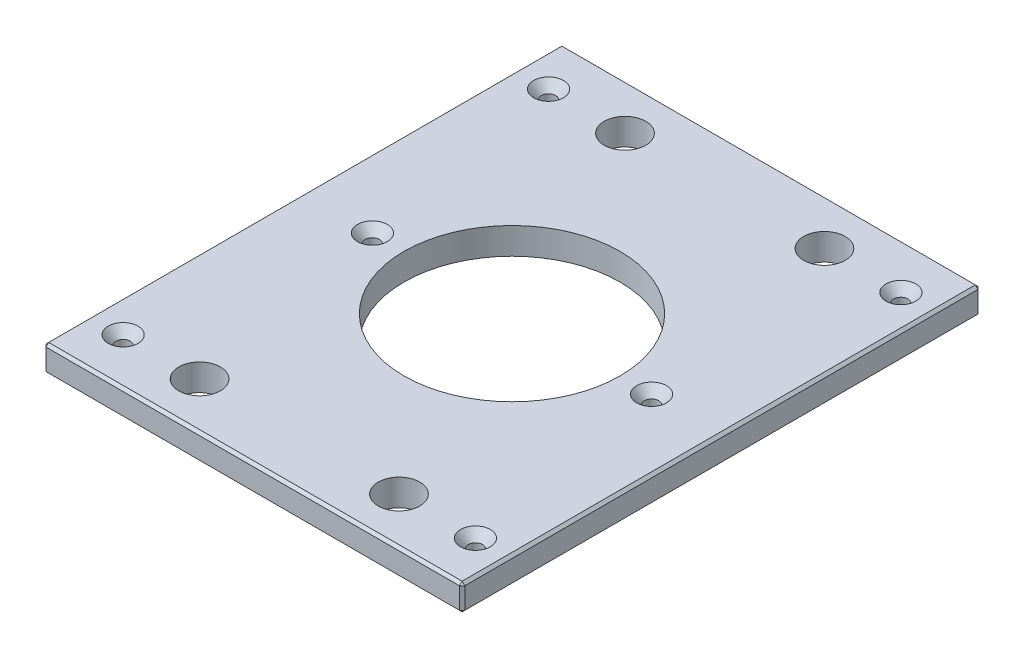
from build123d import *

# Parameters (mm, degrees)
SKETCH1_W                                        = 200.025
SKETCH1_H                                        = 247.65
BOSS_EXTRUDE1_DEPTH                              = 12.7
SKETCH13_R                                       = 51.562
CUT_EXTRUDE6_DEPTH                               = 160.675986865
F_25_32_0_78125_DIAMETER_HOLE1_D                 = 19.84375
CHAMFER2_SIZE                                    = 1.27
CSK_FOR_1_4_FLAT_HEAD_MACHINE_SCREW1_D           = 6.7564
CSK_FOR_1_4_FLAT_HEAD_MACHINE_SCREW1_CSINK_D     = 14.2748
CSK_FOR_1_4_FLAT_HEAD_MACHINE_SCREW1_CSINK_ANGLE = 82


with BuildPart() as part:
    # Sketch1 → Boss-Extrude1 (new body)
    with BuildSketch(Plane(origin=(0, 0, 0), x_dir=(1, 0, 0), z_dir=(0, 1, 0))):
        Rectangle(SKETCH1_W, SKETCH1_H)
    extrude(amount=BOSS_EXTRUDE1_DEPTH)

    # Sketch13 → Cut-Extrude6 (cut, through all)
    with BuildSketch(Plane(origin=(0, 12.7, 0), x_dir=(1, 0, 0), z_dir=(0, 1, 0))):
        with Locations(Location((0, 0, 0), (0, 0, 270))):
            Circle(SKETCH13_R)
    extrude(amount=-CUT_EXTRUDE6_DEPTH, mode=Mode.SUBTRACT)

    # 25_32 _0.78125_ Diameter Hole1 (through all)
    with Locations(Plane(origin=(0, 12.7, 0), x_dir=(1, 0, 0), z_dir=(0, 1, 0))):
        with Locations((47.625, 101.6), (-47.625, 101.6), (47.625, -101.6), (-47.625, -101.6)):
            Hole(F_25_32_0_78125_DIAMETER_HOLE1_D / 2)

    # Chamfer2
    chamfer2_edges = [part.edges().sort_by_distance(p)[0] for p in [
        (100.0125, 12.7, 0),
        (0, 12.7, -123.825),
        (-100.0125, 12.7, 0),
        (0, 0, -123.825),
        (100.0125, 0, 0),
        (0, 0, 123.825),
        (-100.0125, 0, 0),
        (0, 12.7, 123.825),
        (-100.0125, 6.35, -123.825),
        (100.0125, 6.35, -123.825),
        (100.0125, 6.35, 123.825),
        (-100.0125, 6.35, 123.825),
    ]]
    chamfer(chamfer2_edges, length=CHAMFER2_SIZE)

    # CSK for 1_4 Flat Head Machine Screw1 (through all)
    with Locations(Plane(origin=(0, 12.7, 0), x_dir=(1, 0, 0), z_dir=(0, 1, 0))):
        with Locations((84.1375, 101.6), (84.1375, -101.6), (-84.1375, -101.6), (-66.675, 0), (66.675, 0), (-84.1375, 101.6), (-47.625, 101.6), (-47.625, -101.6)):
            CounterSinkHole(CSK_FOR_1_4_FLAT_HEAD_MACHINE_SCREW1_D / 2, CSK_FOR_1_4_FLAT_HEAD_MACHINE_SCREW1_CSINK_D / 2, counter_sink_angle=CSK_FOR_1_4_FLAT_HEAD_MACHINE_SCREW1_CSINK_ANGLE)


solid = part.part
